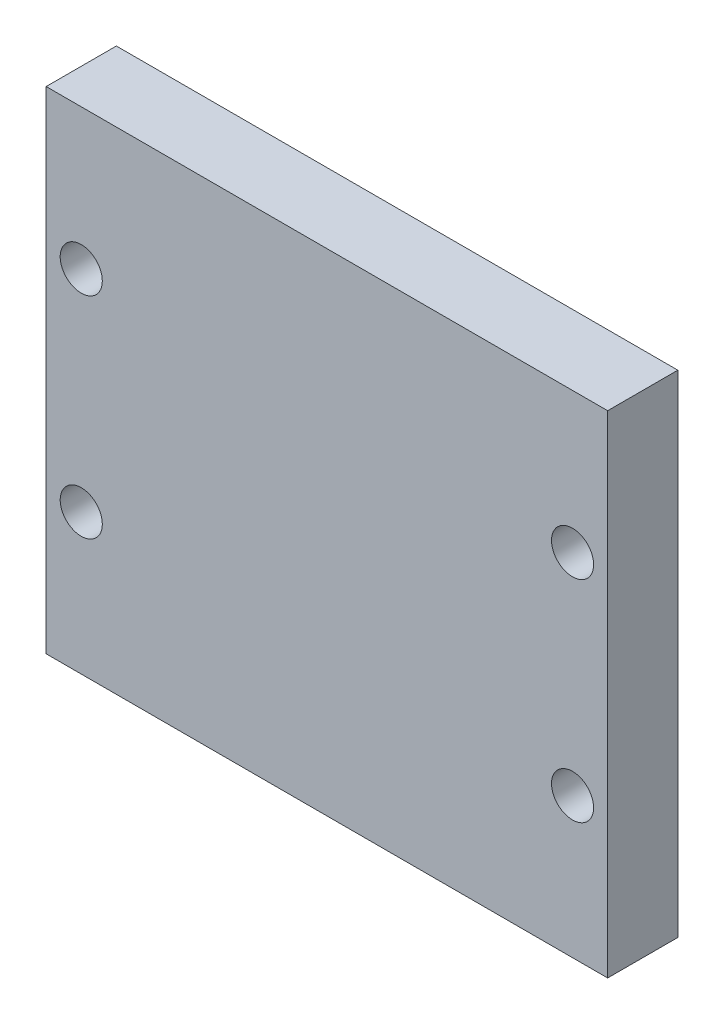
from build123d import *

# Parameters (mm, degrees)
SKETCH1_W           = 40
SKETCH1_H           = 35
SKETCH1_R           = 1.5
BOSS_EXTRUDE1_DEPTH = 5


with BuildPart() as part:
    # Sketch1 → Boss-Extrude1 (new body)
    with BuildSketch(Plane.XY):
        with Locations((0.1, -173.501750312)):
            Rectangle(SKETCH1_W, SKETCH1_H)
        with Locations((-17.4, -166.001750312)):
            Circle(SKETCH1_R, mode=Mode.SUBTRACT)
        with Locations((-17.4, -181.001750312)):
            Circle(SKETCH1_R, mode=Mode.SUBTRACT)
        with Locations((17.6, -181.001750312)):
            Circle(SKETCH1_R, mode=Mode.SUBTRACT)
        with Locations((17.6, -166.001750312)):
            Circle(SKETCH1_R, mode=Mode.SUBTRACT)
    extrude(amount=BOSS_EXTRUDE1_DEPTH)


solid = part.part
